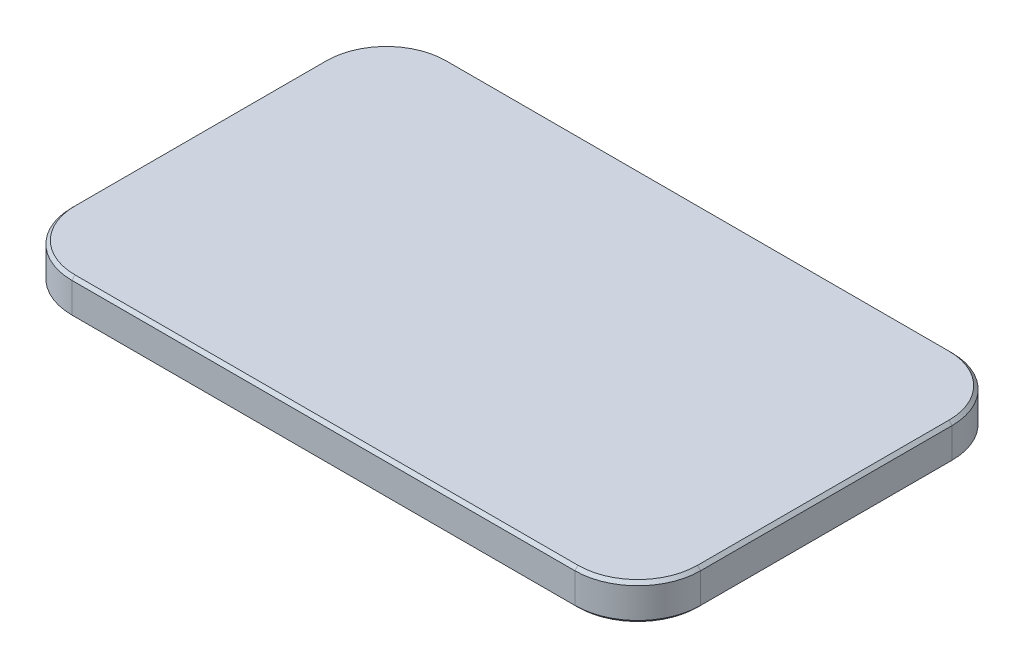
from build123d import *

# Parameters (mm, degrees)
SKETCH1_W      = 127
SKETCH1_H      = 76.2
EXTRUDE1_DEPTH = 7.342722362
FILLET1_R      = 12.7
CHAMFER1_SIZE  = 0.635


with BuildPart() as part:
    # Sketch1 → Extrude1 (new body)
    with BuildSketch(Plane(origin=(0, 0, 0), x_dir=(1, 0, 0), z_dir=(0, 1, 0))):
        Rectangle(SKETCH1_W, SKETCH1_H)
    extrude(amount=EXTRUDE1_DEPTH)

    # Fillet1
    fillet1_edges = [part.edges().sort_by_distance(p)[0] for p in [
        (-63.5, 3.671361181, -38.1),
        (63.5, 3.671361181, -38.1),
        (63.5, 3.671361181, 38.1),
        (-63.5, 3.671361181, 38.1),
    ]]
    fillet(fillet1_edges, radius=FILLET1_R)

    # Chamfer1
    chamfer1_edges = [part.edges().sort_by_distance(p)[0] for p in [
        (-63.5, 0, 0),
        (-63.5, 7.342722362, 0),
        (0, 0, -38.1),
        (63.5, 0, 0),
        (0, 0, 38.1),
        (59.780256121, 0, 34.380256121),
        (-59.780256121, 0, 34.380256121),
        (59.780256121, 0, -34.380256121),
        (-59.780256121, 0, -34.380256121),
        (0, 7.342722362, -38.1),
        (0, 7.342722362, 38.1),
        (63.5, 7.342722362, 0),
        (59.780256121, 7.342722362, 34.380256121),
        (-59.780256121, 7.342722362, 34.380256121),
        (59.780256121, 7.342722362, -34.380256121),
        (-59.780256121, 7.342722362, -34.380256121),
    ]]
    chamfer(chamfer1_edges, length=CHAMFER1_SIZE)


solid = part.part
